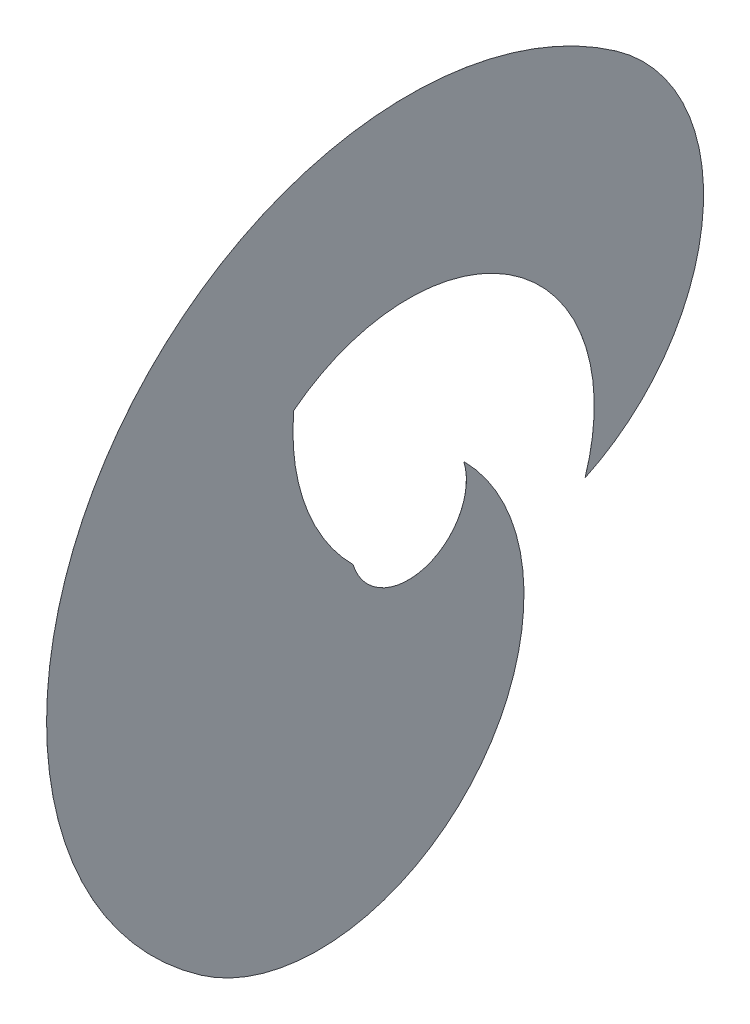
ISO-10303-21;
HEADER;
FILE_DESCRIPTION(('STEP AP214'),'2;1');
FILE_NAME('part.step','',(''),(''),'','','');
FILE_SCHEMA(('AUTOMOTIVE_DESIGN { 1 0 10303 214 1 1 1 1 }'));
ENDSEC;
DATA;
#1=APPLICATION_CONTEXT('core data for automotive mechanical design processes');
#2=APPLICATION_PROTOCOL_DEFINITION('international standard','automotive_design',2000,#1);
#3=PRODUCT_CONTEXT('',#1,'mechanical');
#4=PRODUCT('Part','Part','',(#3));
#5=PRODUCT_RELATED_PRODUCT_CATEGORY('part','',(#4));
#6=PRODUCT_DEFINITION_FORMATION('','',#4);
#7=PRODUCT_DEFINITION_CONTEXT('part definition',#1,'design');
#8=PRODUCT_DEFINITION('design','',#6,#7);
#9=PRODUCT_DEFINITION_SHAPE('','',#8);
#10=(LENGTH_UNIT() NAMED_UNIT(*) SI_UNIT(.MILLI.,.METRE.));
#11=(NAMED_UNIT(*) PLANE_ANGLE_UNIT() SI_UNIT($,.RADIAN.));
#12=(NAMED_UNIT(*) SI_UNIT($,.STERADIAN.) SOLID_ANGLE_UNIT());
#13=UNCERTAINTY_MEASURE_WITH_UNIT(LENGTH_MEASURE(1.E-05),#10,'distance_accuracy_value','');
#14=(GEOMETRIC_REPRESENTATION_CONTEXT(3) GLOBAL_UNCERTAINTY_ASSIGNED_CONTEXT((#13)) GLOBAL_UNIT_ASSIGNED_CONTEXT((#10,
#11,#12)) REPRESENTATION_CONTEXT('',''));
#15=CARTESIAN_POINT('',(0.,0.,0.));
#16=DIRECTION('',(0.,0.,1.));
#17=DIRECTION('',(1.,0.,0.));
#18=AXIS2_PLACEMENT_3D('',#15,#16,#17);
#19=CARTESIAN_POINT('',(0.1,1361.47075808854,-243.275735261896));
#20=DIRECTION('',(-1.,0.,0.));
#21=DIRECTION('',(0.,0.,1.));
#22=AXIS2_PLACEMENT_3D('',#19,#20,#21);
#23=CYLINDRICAL_SURFACE('',#22,1127.87410644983);
#24=CARTESIAN_POINT('',(0.,1361.47075808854,-243.275735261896));
#25=DIRECTION('',(1.,0.,0.));
#26=DIRECTION('',(0.,0.,-1.));
#27=AXIS2_PLACEMENT_3D('',#24,#25,#26);
#28=CIRCLE('',#27,1127.87410644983);
#29=CARTESIAN_POINT('',(0.,339.269672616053,-719.935929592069));
#30=VERTEX_POINT('',#29);
#31=CARTESIAN_POINT('',(0.,2285.37113808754,-890.197745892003));
#32=VERTEX_POINT('',#31);
#33=EDGE_CURVE('E120',#30,#32,#28,.T.);
#34=ORIENTED_EDGE('',*,*,#33,.T.);
#35=DIRECTION('',(-1.,0.,0.));
#36=VECTOR('',#35,1.);
#37=CARTESIAN_POINT('',(0.1,2285.37113808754,-890.197745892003));
#38=LINE('',#37,#36);
#39=CARTESIAN_POINT('',(0.1,2285.37113808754,-890.197745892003));
#40=VERTEX_POINT('',#39);
#41=EDGE_CURVE('E11',#40,#32,#38,.T.);
#42=ORIENTED_EDGE('',*,*,#41,.F.);
#43=CARTESIAN_POINT('',(0.1,1361.47075808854,-243.275735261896));
#44=DIRECTION('',(1.,0.,0.));
#45=DIRECTION('',(0.,0.,-1.));
#46=AXIS2_PLACEMENT_3D('',#43,#44,#45);
#47=CIRCLE('',#46,1127.87410644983);
#48=CARTESIAN_POINT('',(0.1,339.269672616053,-719.935929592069));
#49=VERTEX_POINT('',#48);
#50=EDGE_CURVE('E130',#49,#40,#47,.T.);
#51=ORIENTED_EDGE('',*,*,#50,.F.);
#52=DIRECTION('',(-1.,0.,0.));
#53=VECTOR('',#52,1.);
#54=CARTESIAN_POINT('',(0.1,339.269672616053,-719.935929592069));
#55=LINE('',#54,#53);
#56=EDGE_CURVE('E116',#49,#30,#55,.T.);
#57=ORIENTED_EDGE('',*,*,#56,.T.);
#58=EDGE_LOOP('',(#34,#42,#51,#57));
#59=FACE_BOUND('',#58,.T.);
#60=ADVANCED_FACE('F36',(#59),#23,.T.);
#61=CARTESIAN_POINT('',(0.1,657.,250.));
#62=DIRECTION('',(-1.,0.,0.));
#63=DIRECTION('',(0.,0.,1.));
#64=AXIS2_PLACEMENT_3D('',#61,#62,#63);
#65=CYLINDRICAL_SURFACE('',#64,1987.87410644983);
#66=CARTESIAN_POINT('',(0.,657.,250.));
#67=DIRECTION('',(1.,0.,0.));
#68=DIRECTION('',(0.,0.,-1.));
#69=AXIS2_PLACEMENT_3D('',#66,#67,#68);
#70=CIRCLE('',#69,1987.87410644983);
#71=CARTESIAN_POINT('',(0.,-971.371138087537,1390.197745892));
#72=VERTEX_POINT('',#71);
#73=EDGE_CURVE('E123',#32,#72,#70,.T.);
#74=ORIENTED_EDGE('',*,*,#73,.T.);
#75=DIRECTION('',(-1.,0.,0.));
#76=VECTOR('',#75,1.);
#77=CARTESIAN_POINT('',(0.1,-971.371138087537,1390.197745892));
#78=LINE('',#77,#76);
#79=CARTESIAN_POINT('',(0.1,-971.371138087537,1390.197745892));
#80=VERTEX_POINT('',#79);
#81=EDGE_CURVE('E44',#80,#72,#78,.T.);
#82=ORIENTED_EDGE('',*,*,#81,.F.);
#83=CARTESIAN_POINT('',(0.1,657.,250.));
#84=DIRECTION('',(1.,0.,0.));
#85=DIRECTION('',(0.,0.,-1.));
#86=AXIS2_PLACEMENT_3D('',#83,#84,#85);
#87=CIRCLE('',#86,1987.87410644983);
#88=EDGE_CURVE('E89',#40,#80,#87,.T.);
#89=ORIENTED_EDGE('',*,*,#88,.F.);
#90=ORIENTED_EDGE('',*,*,#41,.T.);
#91=EDGE_LOOP('',(#74,#82,#89,#90));
#92=FACE_BOUND('',#91,.T.);
#93=ADVANCED_FACE('F154',(#92),#65,.T.);
#94=CARTESIAN_POINT('',(0.1,-47.4707580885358,743.275735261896));
#95=DIRECTION('',(-1.,0.,0.));
#96=DIRECTION('',(0.,0.,1.));
#97=AXIS2_PLACEMENT_3D('',#94,#95,#96);
#98=CYLINDRICAL_SURFACE('',#97,1127.87410644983);
#99=CARTESIAN_POINT('',(0.,-47.4707580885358,743.275735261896));
#100=DIRECTION('',(1.,0.,0.));
#101=DIRECTION('',(0.,0.,-1.));
#102=AXIS2_PLACEMENT_3D('',#99,#100,#101);
#103=CIRCLE('',#102,1127.87410644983);
#104=CARTESIAN_POINT('',(0.,750.056670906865,-54.2516937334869));
#105=VERTEX_POINT('',#104);
#106=EDGE_CURVE('E125',#72,#105,#103,.T.);
#107=ORIENTED_EDGE('',*,*,#106,.T.);
#108=DIRECTION('',(-1.,0.,0.));
#109=VECTOR('',#108,1.);
#110=CARTESIAN_POINT('',(0.1,750.056670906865,-54.2516937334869));
#111=LINE('',#110,#109);
#112=CARTESIAN_POINT('',(0.1,750.056670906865,-54.2516937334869));
#113=VERTEX_POINT('',#112);
#114=EDGE_CURVE('E111',#113,#105,#111,.T.);
#115=ORIENTED_EDGE('',*,*,#114,.F.);
#116=CARTESIAN_POINT('',(0.1,-47.4707580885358,743.275735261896));
#117=DIRECTION('',(1.,0.,0.));
#118=DIRECTION('',(0.,0.,-1.));
#119=AXIS2_PLACEMENT_3D('',#116,#117,#118);
#120=CIRCLE('',#119,1127.87410644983);
#121=EDGE_CURVE('E102',#80,#113,#120,.T.);
#122=ORIENTED_EDGE('',*,*,#121,.F.);
#123=ORIENTED_EDGE('',*,*,#81,.T.);
#124=EDGE_LOOP('',(#107,#115,#122,#123));
#125=FACE_BOUND('',#124,.T.);
#126=ADVANCED_FACE('F136',(#125),#98,.T.);
#127=CARTESIAN_POINT('',(0.1,657.,250.));
#128=DIRECTION('',(-1.,0.,0.));
#129=DIRECTION('',(0.,0.,1.));
#130=AXIS2_PLACEMENT_3D('',#127,#128,#129);
#131=CYLINDRICAL_SURFACE('',#130,318.164481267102);
#132=CARTESIAN_POINT('',(0.,657.,250.));
#133=DIRECTION('',(-1.,0.,0.));
#134=DIRECTION('',(0.,0.,1.));
#135=AXIS2_PLACEMENT_3D('',#132,#133,#134);
#136=CIRCLE('',#135,318.164481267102);
#137=CARTESIAN_POINT('',(0.,563.943329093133,554.251693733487));
#138=VERTEX_POINT('',#137);
#139=EDGE_CURVE('E110',#105,#138,#136,.T.);
#140=ORIENTED_EDGE('',*,*,#139,.T.);
#141=DIRECTION('',(-1.,0.,0.));
#142=VECTOR('',#141,1.);
#143=CARTESIAN_POINT('',(0.1,563.943329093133,554.251693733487));
#144=LINE('',#143,#142);
#145=CARTESIAN_POINT('',(0.1,563.943329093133,554.251693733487));
#146=VERTEX_POINT('',#145);
#147=EDGE_CURVE('E107',#146,#138,#144,.T.);
#148=ORIENTED_EDGE('',*,*,#147,.F.);
#149=CARTESIAN_POINT('',(0.1,657.,250.));
#150=DIRECTION('',(-1.,0.,0.));
#151=DIRECTION('',(0.,0.,1.));
#152=AXIS2_PLACEMENT_3D('',#149,#150,#151);
#153=CIRCLE('',#152,318.164481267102);
#154=EDGE_CURVE('E96',#113,#146,#153,.T.);
#155=ORIENTED_EDGE('',*,*,#154,.F.);
#156=ORIENTED_EDGE('',*,*,#114,.T.);
#157=EDGE_LOOP('',(#140,#148,#155,#156));
#158=FACE_BOUND('',#157,.T.);
#159=ADVANCED_FACE('F108',(#158),#131,.F.);
#160=CARTESIAN_POINT('',(0.1,1361.47075808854,-243.275735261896));
#161=DIRECTION('',(-1.,0.,0.));
#162=DIRECTION('',(0.,0.,1.));
#163=AXIS2_PLACEMENT_3D('',#160,#161,#162);
#164=CYLINDRICAL_SURFACE('',#163,1127.87410644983);
#165=CARTESIAN_POINT('',(0.,1361.47075808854,-243.275735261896));
#166=DIRECTION('',(-1.,0.,0.));
#167=DIRECTION('',(0.,0.,-1.));
#168=AXIS2_PLACEMENT_3D('',#165,#166,#167);
#169=CIRCLE('',#168,1127.87410644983);
#170=CARTESIAN_POINT('',(0.,1459.77146356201,880.30646969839));
#171=VERTEX_POINT('',#170);
#172=EDGE_CURVE('E75',#138,#171,#169,.T.);
#173=ORIENTED_EDGE('',*,*,#172,.T.);
#174=DIRECTION('',(-1.,0.,0.));
#175=VECTOR('',#174,1.);
#176=CARTESIAN_POINT('',(0.1,1459.77146356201,880.30646969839));
#177=LINE('',#176,#175);
#178=CARTESIAN_POINT('',(0.1,1459.77146356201,880.30646969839));
#179=VERTEX_POINT('',#178);
#180=EDGE_CURVE('E112',#179,#171,#177,.T.);
#181=ORIENTED_EDGE('',*,*,#180,.F.);
#182=CARTESIAN_POINT('',(0.1,1361.47075808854,-243.275735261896));
#183=DIRECTION('',(-1.,0.,0.));
#184=DIRECTION('',(0.,0.,-1.));
#185=AXIS2_PLACEMENT_3D('',#182,#183,#184);
#186=CIRCLE('',#185,1127.87410644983);
#187=EDGE_CURVE('E100',#146,#179,#186,.T.);
#188=ORIENTED_EDGE('',*,*,#187,.F.);
#189=ORIENTED_EDGE('',*,*,#147,.T.);
#190=EDGE_LOOP('',(#173,#181,#188,#189));
#191=FACE_BOUND('',#190,.T.);
#192=ADVANCED_FACE('F114',(#191),#164,.F.);
#193=CARTESIAN_POINT('',(0.1,657.,250.));
#194=DIRECTION('',(-1.,0.,0.));
#195=DIRECTION('',(0.,0.,1.));
#196=AXIS2_PLACEMENT_3D('',#193,#194,#195);
#197=CYLINDRICAL_SURFACE('',#196,1020.65090430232);
#198=CARTESIAN_POINT('',(0.,657.,250.));
#199=DIRECTION('',(-1.,0.,0.));
#200=DIRECTION('',(0.,0.,-1.));
#201=AXIS2_PLACEMENT_3D('',#198,#199,#200);
#202=CIRCLE('',#201,1020.65090430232);
#203=EDGE_CURVE('E81',#171,#30,#202,.T.);
#204=ORIENTED_EDGE('',*,*,#203,.T.);
#205=ORIENTED_EDGE('',*,*,#56,.F.);
#206=CARTESIAN_POINT('',(0.1,657.,250.));
#207=DIRECTION('',(-1.,0.,0.));
#208=DIRECTION('',(0.,0.,-1.));
#209=AXIS2_PLACEMENT_3D('',#206,#207,#208);
#210=CIRCLE('',#209,1020.65090430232);
#211=EDGE_CURVE('E52',#179,#49,#210,.T.);
#212=ORIENTED_EDGE('',*,*,#211,.F.);
#213=ORIENTED_EDGE('',*,*,#180,.T.);
#214=EDGE_LOOP('',(#204,#205,#212,#213));
#215=FACE_BOUND('',#214,.T.);
#216=ADVANCED_FACE('F143',(#215),#197,.F.);
#217=CARTESIAN_POINT('',(0.1,1009.23537904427,3.36213236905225));
#218=DIRECTION('',(1.,0.,0.));
#219=DIRECTION('',(0.,0.,-1.));
#220=AXIS2_PLACEMENT_3D('',#217,#218,#219);
#221=PLANE('',#220);
#222=ORIENTED_EDGE('',*,*,#50,.T.);
#223=ORIENTED_EDGE('',*,*,#88,.T.);
#224=ORIENTED_EDGE('',*,*,#121,.T.);
#225=ORIENTED_EDGE('',*,*,#154,.T.);
#226=ORIENTED_EDGE('',*,*,#187,.T.);
#227=ORIENTED_EDGE('',*,*,#211,.T.);
#228=EDGE_LOOP('',(#222,#223,#224,#225,#226,#227));
#229=FACE_BOUND('',#228,.T.);
#230=ADVANCED_FACE('F98',(#229),#221,.T.);
#231=CARTESIAN_POINT('',(0.,1009.23537904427,3.36213236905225));
#232=DIRECTION('',(1.,0.,0.));
#233=DIRECTION('',(0.,0.,-1.));
#234=AXIS2_PLACEMENT_3D('',#231,#232,#233);
#235=PLANE('',#234);
#236=ORIENTED_EDGE('',*,*,#33,.F.);
#237=ORIENTED_EDGE('',*,*,#203,.F.);
#238=ORIENTED_EDGE('',*,*,#172,.F.);
#239=ORIENTED_EDGE('',*,*,#139,.F.);
#240=ORIENTED_EDGE('',*,*,#106,.F.);
#241=ORIENTED_EDGE('',*,*,#73,.F.);
#242=EDGE_LOOP('',(#236,#237,#238,#239,#240,#241));
#243=FACE_BOUND('',#242,.T.);
#244=ADVANCED_FACE('F139',(#243),#235,.F.);
#245=CLOSED_SHELL('',(#60,#93,#126,#159,#192,#216,#230,#244));
#246=MANIFOLD_SOLID_BREP('B2',#245);
#247=ADVANCED_BREP_SHAPE_REPRESENTATION('',(#18,#246),#14);
#248=SHAPE_DEFINITION_REPRESENTATION(#9,#247);
ENDSEC;
END-ISO-10303-21;
